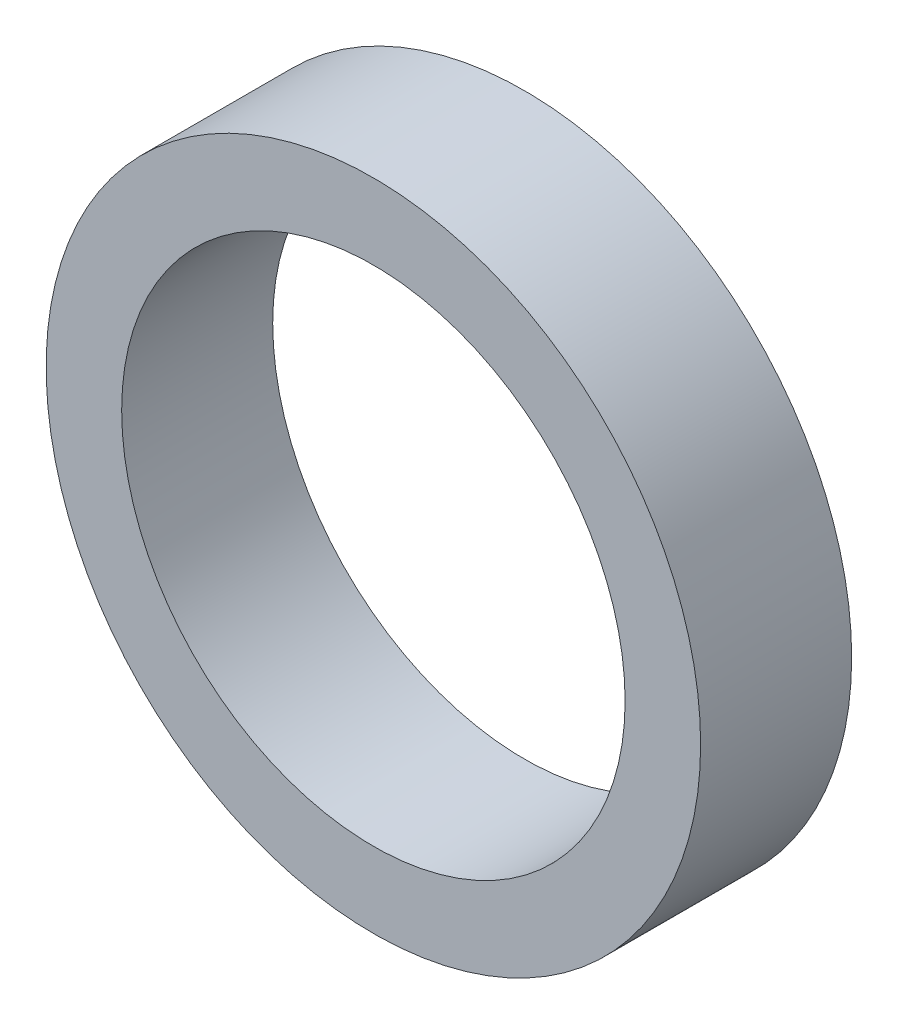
from build123d import *

# Parameters (mm, degrees)
ESQUISSE1_R          = 6.5
ESQUISSE1_R_2        = 5
BASE_EXTRUSION_DEPTH = 3


with BuildPart() as part:
    # Esquisse1 → Base-Extrusion (new body)
    with BuildSketch(Plane.XY):
        Circle(ESQUISSE1_R)
        Circle(ESQUISSE1_R_2, mode=Mode.SUBTRACT)
    extrude(amount=-BASE_EXTRUSION_DEPTH)


solid = part.part
